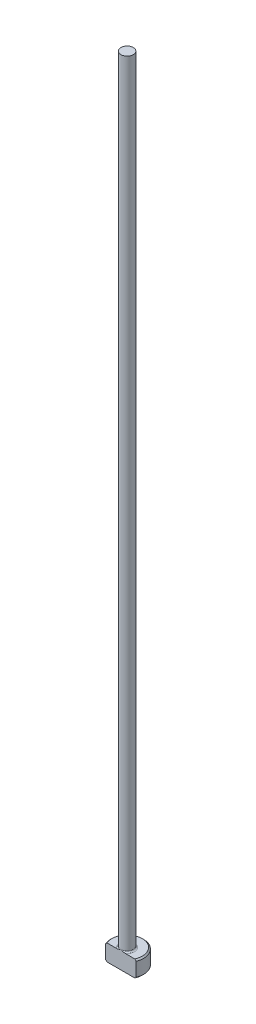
ISO-10303-21;
HEADER;
FILE_DESCRIPTION(('STEP AP214'),'2;1');
FILE_NAME('part.step','',(''),(''),'','','');
FILE_SCHEMA(('AUTOMOTIVE_DESIGN { 1 0 10303 214 1 1 1 1 }'));
ENDSEC;
DATA;
#1=APPLICATION_CONTEXT('core data for automotive mechanical design processes');
#2=APPLICATION_PROTOCOL_DEFINITION('international standard','automotive_design',2000,#1);
#3=PRODUCT_CONTEXT('',#1,'mechanical');
#4=PRODUCT('Part','Part','',(#3));
#5=PRODUCT_RELATED_PRODUCT_CATEGORY('part','',(#4));
#6=PRODUCT_DEFINITION_FORMATION('','',#4);
#7=PRODUCT_DEFINITION_CONTEXT('part definition',#1,'design');
#8=PRODUCT_DEFINITION('design','',#6,#7);
#9=PRODUCT_DEFINITION_SHAPE('','',#8);
#10=(LENGTH_UNIT() NAMED_UNIT(*) SI_UNIT(.MILLI.,.METRE.));
#11=(NAMED_UNIT(*) PLANE_ANGLE_UNIT() SI_UNIT($,.RADIAN.));
#12=(NAMED_UNIT(*) SI_UNIT($,.STERADIAN.) SOLID_ANGLE_UNIT());
#13=UNCERTAINTY_MEASURE_WITH_UNIT(LENGTH_MEASURE(1.E-05),#10,'distance_accuracy_value','');
#14=(GEOMETRIC_REPRESENTATION_CONTEXT(3) GLOBAL_UNCERTAINTY_ASSIGNED_CONTEXT((#13)) GLOBAL_UNIT_ASSIGNED_CONTEXT((#10,
#11,#12)) REPRESENTATION_CONTEXT('',''));
#15=CARTESIAN_POINT('',(0.,0.,0.));
#16=DIRECTION('',(0.,0.,1.));
#17=DIRECTION('',(1.,0.,0.));
#18=AXIS2_PLACEMENT_3D('',#15,#16,#17);
#19=CARTESIAN_POINT('',(0.,0.,0.));
#20=DIRECTION('',(0.,-1.,0.));
#21=DIRECTION('',(0.,0.,-1.));
#22=AXIS2_PLACEMENT_3D('',#19,#20,#21);
#23=PLANE('',#22);
#24=CARTESIAN_POINT('',(0.,0.,0.));
#25=DIRECTION('',(0.,-1.,0.));
#26=DIRECTION('',(0.,0.,-1.));
#27=AXIS2_PLACEMENT_3D('',#24,#25,#26);
#28=CIRCLE('',#27,2.92099999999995);
#29=CARTESIAN_POINT('',(-2.66761406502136,0.,1.18998999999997));
#30=VERTEX_POINT('',#29);
#31=CARTESIAN_POINT('',(2.66761406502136,0.,1.18998999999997));
#32=VERTEX_POINT('',#31);
#33=EDGE_CURVE('E98',#30,#32,#28,.T.);
#34=ORIENTED_EDGE('',*,*,#33,.T.);
#35=DIRECTION('',(-1.,0.,0.));
#36=VECTOR('',#35,1.);
#37=CARTESIAN_POINT('',(-2.94356056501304,0.,1.18998999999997));
#38=LINE('',#37,#36);
#39=EDGE_CURVE('E83',#32,#30,#38,.T.);
#40=ORIENTED_EDGE('',*,*,#39,.T.);
#41=EDGE_LOOP('',(#34,#40));
#42=FACE_BOUND('',#41,.T.);
#43=ADVANCED_FACE('F32',(#42),#23,.T.);
#44=CARTESIAN_POINT('',(0.,259.958771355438,0.));
#45=DIRECTION('',(0.,1.,0.));
#46=DIRECTION('',(0.,0.,1.));
#47=AXIS2_PLACEMENT_3D('',#44,#45,#46);
#48=CYLINDRICAL_SURFACE('',#47,3.17499999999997);
#49=CARTESIAN_POINT('',(0.,2.92099999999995,0.));
#50=DIRECTION('',(0.,1.,0.));
#51=DIRECTION('',(0.,0.,1.));
#52=AXIS2_PLACEMENT_3D('',#49,#50,#51);
#53=CIRCLE('',#52,3.17499999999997);
#54=CARTESIAN_POINT('',(-2.94356056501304,2.92099999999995,1.18998999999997));
#55=VERTEX_POINT('',#54);
#56=CARTESIAN_POINT('',(2.94356056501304,2.92099999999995,1.18998999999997));
#57=VERTEX_POINT('',#56);
#58=EDGE_CURVE('E104',#55,#57,#53,.F.);
#59=ORIENTED_EDGE('',*,*,#58,.T.);
#60=DIRECTION('',(0.,-1.,0.));
#61=VECTOR('',#60,1.);
#62=CARTESIAN_POINT('',(2.94356056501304,152.4,1.18998999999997));
#63=LINE('',#62,#61);
#64=CARTESIAN_POINT('',(2.94356056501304,0.254000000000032,1.18998999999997));
#65=VERTEX_POINT('',#64);
#66=EDGE_CURVE('E183',#57,#65,#63,.T.);
#67=ORIENTED_EDGE('',*,*,#66,.T.);
#68=CARTESIAN_POINT('',(0.,0.254000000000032,0.));
#69=DIRECTION('',(0.,-1.,0.));
#70=DIRECTION('',(0.,0.,-1.));
#71=AXIS2_PLACEMENT_3D('',#68,#69,#70);
#72=CIRCLE('',#71,3.17499999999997);
#73=CARTESIAN_POINT('',(-2.94356056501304,0.254000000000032,1.18998999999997));
#74=VERTEX_POINT('',#73);
#75=EDGE_CURVE('E100',#65,#74,#72,.F.);
#76=ORIENTED_EDGE('',*,*,#75,.T.);
#77=DIRECTION('',(0.,-1.,0.));
#78=VECTOR('',#77,1.);
#79=CARTESIAN_POINT('',(-2.94356056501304,152.4,1.18998999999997));
#80=LINE('',#79,#78);
#81=EDGE_CURVE('E93',#55,#74,#80,.T.);
#82=ORIENTED_EDGE('',*,*,#81,.F.);
#83=EDGE_LOOP('',(#59,#67,#76,#82));
#84=FACE_BOUND('',#83,.T.);
#85=ADVANCED_FACE('F158',(#84),#48,.T.);
#86=CARTESIAN_POINT('',(-3.17499999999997,3.175,0.));
#87=DIRECTION('',(0.,1.,0.));
#88=DIRECTION('',(0.,0.,1.));
#89=AXIS2_PLACEMENT_3D('',#86,#87,#88);
#90=PLANE('',#89);
#91=CARTESIAN_POINT('',(0.,3.175,0.));
#92=DIRECTION('',(0.,1.,0.));
#93=DIRECTION('',(0.,0.,1.));
#94=AXIS2_PLACEMENT_3D('',#91,#92,#93);
#95=CIRCLE('',#94,2.92099999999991);
#96=CARTESIAN_POINT('',(2.66761406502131,3.175,1.18998999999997));
#97=VERTEX_POINT('',#96);
#98=CARTESIAN_POINT('',(-2.66761406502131,3.175,1.18998999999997));
#99=VERTEX_POINT('',#98);
#100=EDGE_CURVE('E178',#97,#99,#95,.T.);
#101=ORIENTED_EDGE('',*,*,#100,.T.);
#102=DIRECTION('',(1.,0.,0.));
#103=VECTOR('',#102,1.);
#104=CARTESIAN_POINT('',(-3.17499999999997,3.175,1.18998999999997));
#105=LINE('',#104,#103);
#106=CARTESIAN_POINT('',(-0.817943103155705,3.17500000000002,1.18998999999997));
#107=VERTEX_POINT('',#106);
#108=EDGE_CURVE('E57',#99,#107,#105,.T.);
#109=ORIENTED_EDGE('',*,*,#108,.T.);
#110=CARTESIAN_POINT('',(0.,3.175,0.));
#111=DIRECTION('',(0.,1.,0.));
#112=DIRECTION('',(0.,0.,1.));
#113=AXIS2_PLACEMENT_3D('',#110,#111,#112);
#114=CIRCLE('',#113,1.44398999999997);
#115=CARTESIAN_POINT('',(0.817943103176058,3.17500000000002,1.18998999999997));
#116=VERTEX_POINT('',#115);
#117=EDGE_CURVE('E107',#107,#116,#114,.F.);
#118=ORIENTED_EDGE('',*,*,#117,.T.);
#119=EDGE_CURVE('E136',#116,#97,#105,.T.);
#120=ORIENTED_EDGE('',*,*,#119,.T.);
#121=EDGE_LOOP('',(#101,#109,#118,#120));
#122=FACE_BOUND('',#121,.T.);
#123=ADVANCED_FACE('F147',(#122),#90,.T.);
#124=CARTESIAN_POINT('',(0.,3.17499999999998,0.));
#125=DIRECTION('',(0.,-1.,0.));
#126=DIRECTION('',(0.,0.,-1.));
#127=AXIS2_PLACEMENT_3D('',#124,#125,#126);
#128=CONICAL_SURFACE('',#127,2.92099999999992,0.785398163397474);
#129=ORIENTED_EDGE('',*,*,#58,.F.);
#130=CARTESIAN_POINT('',(-6.47931936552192,-0.491689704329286,1.18998999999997));
#131=CARTESIAN_POINT('',(-6.3057518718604,-0.320986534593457,1.18998999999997));
#132=CARTESIAN_POINT('',(-6.13208094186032,-0.150388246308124,1.18998999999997));
#133=CARTESIAN_POINT('',(-5.78425276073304,0.190708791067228,1.18998999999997));
#134=CARTESIAN_POINT('',(-5.610095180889,0.361207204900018,1.18998999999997));
#135=CARTESIAN_POINT('',(-5.25789988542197,0.705253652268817,1.18998999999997));
#136=CARTESIAN_POINT('',(-5.07985463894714,0.878793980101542,1.18998999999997));
#137=CARTESIAN_POINT('',(-4.72344726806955,1.22514212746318,1.18998999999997));
#138=CARTESIAN_POINT('',(-4.54508573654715,1.39795055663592,1.18998999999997));
#139=CARTESIAN_POINT('',(-4.22178053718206,1.70987820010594,1.18998999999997));
#140=CARTESIAN_POINT('',(-4.07696186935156,1.84912689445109,1.18998999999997));
#141=CARTESIAN_POINT('',(-3.78666752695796,2.1269755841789,1.18998999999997));
#142=CARTESIAN_POINT('',(-3.64119177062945,2.26557549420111,1.18998999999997));
#143=CARTESIAN_POINT('',(-3.34872942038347,2.54243487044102,1.18998999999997));
#144=CARTESIAN_POINT('',(-3.20173902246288,2.68069032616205,1.18998999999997));
#145=CARTESIAN_POINT('',(-2.90653907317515,2.95574973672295,1.18998999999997));
#146=CARTESIAN_POINT('',(-2.75833015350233,3.09255436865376,1.18998999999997));
#147=CARTESIAN_POINT('',(-2.46256150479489,3.36167470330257,1.18998999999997));
#148=CARTESIAN_POINT('',(-2.31503539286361,3.49402709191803,1.18998999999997));
#149=CARTESIAN_POINT('',(-2.09131974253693,3.69008529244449,1.18998999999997));
#150=CARTESIAN_POINT('',(-2.01626900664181,3.75508852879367,1.18998999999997));
#151=CARTESIAN_POINT('',(-1.86516644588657,3.88390741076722,1.18998999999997));
#152=CARTESIAN_POINT('',(-1.78911473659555,3.94772319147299,1.18998999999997));
#153=CARTESIAN_POINT('',(-1.63628476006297,4.07322581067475,1.18998999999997));
#154=CARTESIAN_POINT('',(-1.55951715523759,4.13492558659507,1.18998999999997));
#155=CARTESIAN_POINT('',(-1.40419805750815,4.25603341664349,1.18998999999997));
#156=CARTESIAN_POINT('',(-1.32564684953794,4.31544183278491,1.18998999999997));
#157=CARTESIAN_POINT('',(-1.16630337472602,4.43067355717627,1.18998999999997));
#158=CARTESIAN_POINT('',(-1.0855185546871,4.48650710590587,1.18998999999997));
#159=CARTESIAN_POINT('',(-0.920537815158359,4.59284659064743,1.18998999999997));
#160=CARTESIAN_POINT('',(-0.836346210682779,4.64335899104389,1.18998999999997));
#161=CARTESIAN_POINT('',(-0.730888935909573,4.69956746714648,1.18998999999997));
#162=CARTESIAN_POINT('',(-0.71184810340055,4.70944634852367,1.18998999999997));
#163=CARTESIAN_POINT('',(-0.67352119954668,4.72872851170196,1.18998999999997));
#164=CARTESIAN_POINT('',(-0.654235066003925,4.73813166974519,1.18998999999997));
#165=CARTESIAN_POINT('',(-0.59599952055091,4.76554209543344,1.18998999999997));
#166=CARTESIAN_POINT('',(-0.556668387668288,4.7827527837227,1.18998999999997));
#167=CARTESIAN_POINT('',(-0.477355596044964,4.81434640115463,1.18998999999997));
#168=CARTESIAN_POINT('',(-0.437385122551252,4.82875715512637,1.18998999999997));
#169=CARTESIAN_POINT('',(-0.356410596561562,4.85437528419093,1.18998999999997));
#170=CARTESIAN_POINT('',(-0.31540652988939,4.86558261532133,1.18998999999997));
#171=CARTESIAN_POINT('',(-0.239749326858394,4.88255703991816,1.18998999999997));
#172=CARTESIAN_POINT('',(-0.205233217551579,4.88893154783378,1.18998999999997));
#173=CARTESIAN_POINT('',(-0.135794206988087,4.89877967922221,1.18998999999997));
#174=CARTESIAN_POINT('',(-0.100871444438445,4.90225426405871,1.18998999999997));
#175=CARTESIAN_POINT('',(-0.0309424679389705,4.90611831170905,1.18998999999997));
#176=CARTESIAN_POINT('',(0.00406330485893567,4.90651563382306,1.18998999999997));
#177=CARTESIAN_POINT('',(0.0739860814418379,4.90422492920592,1.18998999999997));
#178=CARTESIAN_POINT('',(0.108903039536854,4.90153554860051,1.18998999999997));
#179=CARTESIAN_POINT('',(0.185811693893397,4.89231772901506,1.18998999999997));
#180=CARTESIAN_POINT('',(0.227719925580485,4.88509144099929,1.18998999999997));
#181=CARTESIAN_POINT('',(0.310690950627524,4.86678744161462,1.18998999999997));
#182=CARTESIAN_POINT('',(0.351753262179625,4.85570759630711,1.18998999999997));
#183=CARTESIAN_POINT('',(0.433130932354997,4.83023017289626,1.18998999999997));
#184=CARTESIAN_POINT('',(0.473439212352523,4.8158103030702,1.18998999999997));
#185=CARTESIAN_POINT('',(0.552977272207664,4.78431092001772,1.18998999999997));
#186=CARTESIAN_POINT('',(0.592207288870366,4.76723199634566,1.18998999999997));
#187=CARTESIAN_POINT('',(0.705140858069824,4.7143405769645,1.18998999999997));
#188=CARTESIAN_POINT('',(0.777512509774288,4.67569611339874,1.18998999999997));
#189=CARTESIAN_POINT('',(0.919347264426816,4.59335368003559,1.18998999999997));
#190=CARTESIAN_POINT('',(0.988806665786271,4.54964952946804,1.18998999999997));
#191=CARTESIAN_POINT('',(1.12574256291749,4.45870111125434,1.18998999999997));
#192=CARTESIAN_POINT('',(1.19321018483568,4.41144359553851,1.18998999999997));
#193=CARTESIAN_POINT('',(1.32639871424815,4.31461731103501,1.18998999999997));
#194=CARTESIAN_POINT('',(1.39212046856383,4.26504969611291,1.18998999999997));
#195=CARTESIAN_POINT('',(1.52321682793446,4.163508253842,1.18998999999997));
#196=CARTESIAN_POINT('',(1.58857229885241,4.11150983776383,1.18998999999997));
#197=CARTESIAN_POINT('',(1.71826265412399,4.00624640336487,1.18998999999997));
#198=CARTESIAN_POINT('',(1.78259742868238,3.95298125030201,1.18998999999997));
#199=CARTESIAN_POINT('',(1.9103046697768,3.84563387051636,1.18998999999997));
#200=CARTESIAN_POINT('',(1.97367914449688,3.79155402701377,1.18998999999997));
#201=CARTESIAN_POINT('',(2.09979151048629,3.68266386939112,1.18998999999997));
#202=CARTESIAN_POINT('',(2.1625294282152,3.62785358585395,1.18998999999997));
#203=CARTESIAN_POINT('',(2.32034022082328,3.48869772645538,1.18998999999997));
#204=CARTESIAN_POINT('',(2.41507621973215,3.40397040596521,1.18998999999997));
#205=CARTESIAN_POINT('',(2.60367921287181,3.23355294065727,1.18998999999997));
#206=CARTESIAN_POINT('',(2.69754618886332,3.14786277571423,1.18998999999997));
#207=CARTESIAN_POINT('',(2.97818594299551,2.88972120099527,1.18998999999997));
#208=CARTESIAN_POINT('',(3.1639838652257,2.71621092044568,1.18998999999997));
#209=CARTESIAN_POINT('',(3.53424564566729,2.36730235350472,1.18998999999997));
#210=CARTESIAN_POINT('',(3.71870746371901,2.19190191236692,1.18998999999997));
#211=CARTESIAN_POINT('',(4.08658256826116,1.84002104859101,1.18998999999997));
#212=CARTESIAN_POINT('',(4.26999589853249,1.66354067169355,1.18998999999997));
#213=CARTESIAN_POINT('',(4.62290911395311,1.3225888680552,1.18998999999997));
#214=CARTESIAN_POINT('',(4.79245879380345,1.1581689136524,1.18998999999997));
#215=CARTESIAN_POINT('',(5.13110594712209,0.828859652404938,1.18998999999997));
#216=CARTESIAN_POINT('',(5.30020341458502,0.663970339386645,1.18998999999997));
#217=CARTESIAN_POINT('',(5.63778854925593,0.334103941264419,1.18998999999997));
#218=CARTESIAN_POINT('',(5.80627675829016,0.169127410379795,1.18998999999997));
#219=CARTESIAN_POINT('',(6.14298232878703,-0.161096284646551,1.18998999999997));
#220=CARTESIAN_POINT('',(6.31119969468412,-0.326343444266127,1.18998999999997));
#221=CARTESIAN_POINT('',(6.47931936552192,-0.491689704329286,1.18998999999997));
#222=B_SPLINE_CURVE_WITH_KNOTS('',3,(#130,#131,#132,#133,#134,#135,#136,#137,#138,#139,#140,
#141,#142,#143,#144,#145,#146,#147,#148,#149,#150,#151,#152,#153,#154,#155,#156,#157,#158,#159,
#160,#161,#162,#163,#164,#165,#166,#167,#168,#169,#170,#171,#172,#173,#174,#175,#176,#177,#178,
#179,#180,#181,#182,#183,#184,#185,#186,#187,#188,#189,#190,#191,#192,#193,#194,#195,#196,#197,
#198,#199,#200,#201,#202,#203,#204,#205,#206,#207,#208,#209,#210,#211,#212,#213,#214,#215,#216,
#217,#218,#219,#220,#221),.UNSPECIFIED.,.F.,.F.,(4,2,2,2,2,2,2,2,2,2,2,2,2,2,2,2,2,2,2,2,2,2,2,
2,2,2,2,2,2,2,2,2,2,2,2,2,2,2,2,2,2,2,2,2,2,4),(0.,0.730333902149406,1.46150049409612,
2.20738656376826,2.95242206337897,3.55513421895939,4.15792356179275,4.76329855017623,
5.3683773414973,5.96292222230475,6.26077664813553,6.55859698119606,6.85403741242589,
7.14943097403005,7.44393654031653,7.7380800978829,7.80242723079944,7.866791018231,
7.99550301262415,8.12286192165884,8.25022257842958,8.35541203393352,8.46056660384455,
8.56545252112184,8.67038446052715,8.79775050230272,8.92518718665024,9.05350023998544,
9.18178488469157,9.4275558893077,9.67363035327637,9.92067269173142,10.1675929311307,
10.4181243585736,10.6686825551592,10.9186125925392,11.1685321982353,11.5498128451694,
11.9311014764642,12.6937337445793,13.4573540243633,14.2209421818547,14.9294812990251,
15.638029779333,16.3454542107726,17.0528669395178),.UNSPECIFIED.);
#223=EDGE_CURVE('E135',#55,#99,#222,.T.);
#224=ORIENTED_EDGE('',*,*,#223,.T.);
#225=ORIENTED_EDGE('',*,*,#100,.F.);
#226=EDGE_CURVE('E127',#97,#57,#222,.T.);
#227=ORIENTED_EDGE('',*,*,#226,.T.);
#228=EDGE_LOOP('',(#129,#224,#225,#227));
#229=FACE_BOUND('',#228,.T.);
#230=ADVANCED_FACE('F143',(#229),#128,.T.);
#231=CARTESIAN_POINT('',(0.,0.254000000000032,0.));
#232=DIRECTION('',(0.,1.,0.));
#233=DIRECTION('',(0.,0.,1.));
#234=AXIS2_PLACEMENT_3D('',#231,#232,#233);
#235=CONICAL_SURFACE('',#234,3.17499999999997,0.785398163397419);
#236=ORIENTED_EDGE('',*,*,#75,.F.);
#237=CARTESIAN_POINT('',(6.47931936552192,3.66668970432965,1.18998999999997));
#238=CARTESIAN_POINT('',(6.30575187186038,3.49598653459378,1.18998999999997));
#239=CARTESIAN_POINT('',(6.13208094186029,3.32538824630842,1.18998999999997));
#240=CARTESIAN_POINT('',(5.78425276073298,2.98429120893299,1.18998999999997));
#241=CARTESIAN_POINT('',(5.61009518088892,2.81379279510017,1.18998999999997));
#242=CARTESIAN_POINT('',(5.25789988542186,2.4697463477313,1.18998999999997));
#243=CARTESIAN_POINT('',(5.07985463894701,2.29620601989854,1.18998999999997));
#244=CARTESIAN_POINT('',(4.72344726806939,1.94985787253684,1.18998999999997));
#245=CARTESIAN_POINT('',(4.54508573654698,1.77704944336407,1.18998999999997));
#246=CARTESIAN_POINT('',(4.22178053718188,1.46512179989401,1.18998999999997));
#247=CARTESIAN_POINT('',(4.0769618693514,1.32587310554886,1.18998999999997));
#248=CARTESIAN_POINT('',(3.78666752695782,1.04802441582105,1.18998999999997));
#249=CARTESIAN_POINT('',(3.64119177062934,0.909424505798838,1.18998999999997));
#250=CARTESIAN_POINT('',(3.34872942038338,0.632565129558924,1.18998999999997));
#251=CARTESIAN_POINT('',(3.20173902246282,0.494309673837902,1.18998999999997));
#252=CARTESIAN_POINT('',(2.90653907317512,0.219250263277,1.18998999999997));
#253=CARTESIAN_POINT('',(2.75833015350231,0.0824456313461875,1.18998999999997));
#254=CARTESIAN_POINT('',(2.4625615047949,-0.186674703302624,1.18998999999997));
#255=CARTESIAN_POINT('',(2.31503539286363,-0.319027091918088,1.18998999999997));
#256=CARTESIAN_POINT('',(2.09131974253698,-0.515085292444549,1.18998999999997));
#257=CARTESIAN_POINT('',(2.01626900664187,-0.58008852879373,1.18998999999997));
#258=CARTESIAN_POINT('',(1.86516644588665,-0.708907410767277,1.18998999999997));
#259=CARTESIAN_POINT('',(1.78911473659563,-0.772723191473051,1.18998999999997));
#260=CARTESIAN_POINT('',(1.63628476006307,-0.898225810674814,1.18998999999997));
#261=CARTESIAN_POINT('',(1.5595171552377,-0.959925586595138,1.18998999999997));
#262=CARTESIAN_POINT('',(1.40419805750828,-1.08103341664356,1.18998999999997));
#263=CARTESIAN_POINT('',(1.32564684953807,-1.14044183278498,1.18998999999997));
#264=CARTESIAN_POINT('',(1.16630337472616,-1.25567355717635,1.18998999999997));
#265=CARTESIAN_POINT('',(1.08551855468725,-1.31150710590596,1.18998999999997));
#266=CARTESIAN_POINT('',(0.920537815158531,-1.41784659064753,1.18998999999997));
#267=CARTESIAN_POINT('',(0.83634621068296,-1.46835899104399,1.18998999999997));
#268=CARTESIAN_POINT('',(0.730888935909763,-1.5245674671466,1.18998999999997));
#269=CARTESIAN_POINT('',(0.71184810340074,-1.53444634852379,1.18998999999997));
#270=CARTESIAN_POINT('',(0.673521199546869,-1.55372851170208,1.18998999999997));
#271=CARTESIAN_POINT('',(0.654235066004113,-1.56313166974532,1.18998999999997));
#272=CARTESIAN_POINT('',(0.595999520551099,-1.59054209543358,1.18998999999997));
#273=CARTESIAN_POINT('',(0.556668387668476,-1.60775278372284,1.18998999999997));
#274=CARTESIAN_POINT('',(0.47735559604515,-1.63934640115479,1.18998999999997));
#275=CARTESIAN_POINT('',(0.437385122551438,-1.65375715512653,1.18998999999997));
#276=CARTESIAN_POINT('',(0.356410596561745,-1.67937528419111,1.18998999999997));
#277=CARTESIAN_POINT('',(0.31540652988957,-1.69058261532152,1.18998999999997));
#278=CARTESIAN_POINT('',(0.239749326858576,-1.70755703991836,1.18998999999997));
#279=CARTESIAN_POINT('',(0.205233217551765,-1.71393154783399,1.18998999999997));
#280=CARTESIAN_POINT('',(0.135794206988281,-1.72377967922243,1.18998999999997));
#281=CARTESIAN_POINT('',(0.100871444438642,-1.72725426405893,1.18998999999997));
#282=CARTESIAN_POINT('',(0.030942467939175,-1.73111831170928,1.18998999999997));
#283=CARTESIAN_POINT('',(-0.00406330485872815,-1.73151563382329,1.18998999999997));
#284=CARTESIAN_POINT('',(-0.0739860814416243,-1.72922492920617,1.18998999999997));
#285=CARTESIAN_POINT('',(-0.108903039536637,-1.72653554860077,1.18998999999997));
#286=CARTESIAN_POINT('',(-0.185811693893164,-1.71731772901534,1.18998999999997));
#287=CARTESIAN_POINT('',(-0.227719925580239,-1.71009144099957,1.18998999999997));
#288=CARTESIAN_POINT('',(-0.310690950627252,-1.69178744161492,1.18998999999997));
#289=CARTESIAN_POINT('',(-0.351753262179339,-1.68070759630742,1.18998999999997));
#290=CARTESIAN_POINT('',(-0.433130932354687,-1.6552301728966,1.18998999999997));
#291=CARTESIAN_POINT('',(-0.4734392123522,-1.64081030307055,1.18998999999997));
#292=CARTESIAN_POINT('',(-0.552977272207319,-1.60931092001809,1.18998999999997));
#293=CARTESIAN_POINT('',(-0.592207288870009,-1.59223199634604,1.18998999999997));
#294=CARTESIAN_POINT('',(-0.705140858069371,-1.53934057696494,1.18998999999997));
#295=CARTESIAN_POINT('',(-0.777512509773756,-1.50069611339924,1.18998999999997));
#296=CARTESIAN_POINT('',(-0.919347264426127,-1.41835368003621,1.18998999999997));
#297=CARTESIAN_POINT('',(-0.988806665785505,-1.37464952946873,1.18998999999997));
#298=CARTESIAN_POINT('',(-1.12574256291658,-1.28370111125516,1.18998999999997));
#299=CARTESIAN_POINT('',(-1.19321018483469,-1.2364435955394,1.18998999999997));
#300=CARTESIAN_POINT('',(-1.32639871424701,-1.13961731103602,1.18998999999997));
#301=CARTESIAN_POINT('',(-1.39212046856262,-1.09004969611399,1.18998999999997));
#302=CARTESIAN_POINT('',(-1.52321682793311,-0.988508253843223,1.18998999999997));
#303=CARTESIAN_POINT('',(-1.58857229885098,-0.93650983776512,1.18998999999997));
#304=CARTESIAN_POINT('',(-1.71826265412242,-0.831246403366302,1.18998999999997));
#305=CARTESIAN_POINT('',(-1.78259742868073,-0.777981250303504,1.18998999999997));
#306=CARTESIAN_POINT('',(-1.91030466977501,-0.67063387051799,1.18998999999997));
#307=CARTESIAN_POINT('',(-1.97367914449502,-0.61655402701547,1.18998999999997));
#308=CARTESIAN_POINT('',(-2.09979151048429,-0.507663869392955,1.18998999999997));
#309=CARTESIAN_POINT('',(-2.16252942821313,-0.45285358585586,1.18998999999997));
#310=CARTESIAN_POINT('',(-2.32034022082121,-0.313697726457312,1.18998999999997));
#311=CARTESIAN_POINT('',(-2.41507621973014,-0.228970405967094,1.18998999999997));
#312=CARTESIAN_POINT('',(-2.60367921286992,-0.0585529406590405,1.18998999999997));
#313=CARTESIAN_POINT('',(-2.69754618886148,0.0271372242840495,1.18998999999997));
#314=CARTESIAN_POINT('',(-2.97818594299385,0.285278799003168,1.18998999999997));
#315=CARTESIAN_POINT('',(-3.16398386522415,0.458789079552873,1.18998999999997));
#316=CARTESIAN_POINT('',(-3.53424564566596,0.807697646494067,1.18998999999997));
#317=CARTESIAN_POINT('',(-3.71870746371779,0.983098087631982,1.18998999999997));
#318=CARTESIAN_POINT('',(-4.08658256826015,1.33497895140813,1.18998999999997));
#319=CARTESIAN_POINT('',(-4.26999589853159,1.51145932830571,1.18998999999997));
#320=CARTESIAN_POINT('',(-4.62290911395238,1.85241113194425,1.18998999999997));
#321=CARTESIAN_POINT('',(-4.79245879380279,2.01683108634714,1.18998999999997));
#322=CARTESIAN_POINT('',(-5.13110594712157,2.34614034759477,1.18998999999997));
#323=CARTESIAN_POINT('',(-5.30020341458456,2.51102966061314,1.18998999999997));
#324=CARTESIAN_POINT('',(-5.63778854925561,2.84089605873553,1.18998999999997));
#325=CARTESIAN_POINT('',(-5.8062767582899,3.00587258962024,1.18998999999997));
#326=CARTESIAN_POINT('',(-6.1429823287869,3.33609628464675,1.18998999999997));
#327=CARTESIAN_POINT('',(-6.31119969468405,3.50134344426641,1.18998999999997));
#328=CARTESIAN_POINT('',(-6.47931936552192,3.66668970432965,1.18998999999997));
#329=B_SPLINE_CURVE_WITH_KNOTS('',3,(#237,#238,#239,#240,#241,#242,#243,#244,#245,#246,#247,
#248,#249,#250,#251,#252,#253,#254,#255,#256,#257,#258,#259,#260,#261,#262,#263,#264,#265,#266,
#267,#268,#269,#270,#271,#272,#273,#274,#275,#276,#277,#278,#279,#280,#281,#282,#283,#284,#285,
#286,#287,#288,#289,#290,#291,#292,#293,#294,#295,#296,#297,#298,#299,#300,#301,#302,#303,#304,
#305,#306,#307,#308,#309,#310,#311,#312,#313,#314,#315,#316,#317,#318,#319,#320,#321,#322,#323,
#324,#325,#326,#327,#328),.UNSPECIFIED.,.F.,.F.,(4,2,2,2,2,2,2,2,2,2,2,2,2,2,2,2,2,2,2,2,2,2,2,
2,2,2,2,2,2,2,2,2,2,2,2,2,2,2,2,2,2,2,2,2,2,4),(0.,0.730333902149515,1.46150049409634,
2.20738656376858,2.95242206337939,3.55513421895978,4.15792356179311,4.76329855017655,
5.36837734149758,5.962922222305,6.26077664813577,6.55859698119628,6.8540374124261,
7.14943097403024,7.44393654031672,7.73808009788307,7.80242723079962,7.86679101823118,
7.99550301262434,8.12286192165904,8.25022257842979,8.35541203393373,8.46056660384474,
8.56545252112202,8.67038446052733,8.79775050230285,8.92518718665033,9.05350023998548,
9.18178488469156,9.4275558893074,9.67363035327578,9.92067269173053,10.1675929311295,
10.4181243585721,10.6686825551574,10.9186125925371,11.1685321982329,11.5498128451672,
11.9311014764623,12.6937337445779,13.4573540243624,14.2209421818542,14.929481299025,
15.6380297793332,16.3454542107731,17.0528669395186),.UNSPECIFIED.);
#330=EDGE_CURVE('E86',#65,#32,#329,.T.);
#331=ORIENTED_EDGE('',*,*,#330,.T.);
#332=ORIENTED_EDGE('',*,*,#33,.F.);
#333=EDGE_CURVE('E89',#30,#74,#329,.T.);
#334=ORIENTED_EDGE('',*,*,#333,.T.);
#335=EDGE_LOOP('',(#236,#331,#332,#334));
#336=FACE_BOUND('',#335,.T.);
#337=ADVANCED_FACE('F97',(#336),#235,.T.);
#338=CARTESIAN_POINT('',(0.,3.42900000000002,0.));
#339=DIRECTION('',(0.,1.,0.));
#340=DIRECTION('',(0.,0.,1.));
#341=AXIS2_PLACEMENT_3D('',#338,#339,#340);
#342=TOROIDAL_SURFACE('',#341,1.44398999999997,0.254);
#343=CARTESIAN_POINT('',(0.,3.42900000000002,1.18998999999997));
#344=CARTESIAN_POINT('',(1.26787740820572E-12,3.42900058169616,1.18998999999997));
#345=CARTESIAN_POINT('',(1.02037080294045E-07,3.42900116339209,1.18998999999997));
#346=CARTESIAN_POINT('',(4.36423737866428E-07,3.42900229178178,1.18998999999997));
#347=CARTESIAN_POINT('',(6.71040769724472E-07,3.42900283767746,1.18998999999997));
#348=CARTESIAN_POINT('',(1.23856841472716E-06,3.42900392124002,1.18998999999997));
#349=CARTESIAN_POINT('',(1.57695860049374E-06,3.42900445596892,1.18998999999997));
#350=CARTESIAN_POINT('',(2.31458772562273E-06,3.42900547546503,1.18998999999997));
#351=CARTESIAN_POINT('',(2.71349856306E-06,3.42900596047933,1.18998999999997));
#352=CARTESIAN_POINT('',(4.11884078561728E-06,3.42900754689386,1.18998999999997));
#353=CARTESIAN_POINT('',(5.20568846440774E-06,3.42900857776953,1.18998999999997));
#354=CARTESIAN_POINT('',(7.47790847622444E-06,3.42901044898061,1.18998999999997));
#355=CARTESIAN_POINT('',(8.65996322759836E-06,3.42901129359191,1.18998999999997));
#356=CARTESIAN_POINT('',(1.31663854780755E-05,3.42901436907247,1.18998999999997));
#357=CARTESIAN_POINT('',(1.6609768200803E-05,3.42901643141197,1.18998999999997));
#358=CARTESIAN_POINT('',(2.34843039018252E-05,3.42901989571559,1.18998999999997));
#359=CARTESIAN_POINT('',(2.68971573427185E-05,3.42902133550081,1.18998999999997));
#360=CARTESIAN_POINT('',(4.11260389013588E-05,3.42902727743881,1.18998999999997));
#361=CARTESIAN_POINT('',(5.19833878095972E-05,3.42903166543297,1.18998999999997));
#362=CARTESIAN_POINT('',(7.24910575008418E-05,3.42903888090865,1.18998999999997));
#363=CARTESIAN_POINT('',(8.20928106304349E-05,3.42904184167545,1.18998999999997));
#364=CARTESIAN_POINT('',(0.000150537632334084,3.42906480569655,1.18998999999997));
#365=CARTESIAN_POINT('',(0.000206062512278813,3.42909344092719,1.18998999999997));
#366=CARTESIAN_POINT('',(0.000420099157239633,3.42919967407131,1.18998999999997));
#367=CARTESIAN_POINT('',(0.000580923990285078,3.42927086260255,1.18998999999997));
#368=CARTESIAN_POINT('',(0.00119866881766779,3.42954850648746,1.18998999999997));
#369=CARTESIAN_POINT('',(0.00165320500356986,3.42976167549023,1.18998999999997));
#370=CARTESIAN_POINT('',(0.00349115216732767,3.43061934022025,1.18998999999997));
#371=CARTESIAN_POINT('',(0.00487719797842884,3.43125630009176,1.18998999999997));
#372=CARTESIAN_POINT('',(0.027245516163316,3.44154091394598,1.18998999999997));
#373=CARTESIAN_POINT('',(0.0482060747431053,3.45125229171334,1.18998999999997));
#374=CARTESIAN_POINT('',(0.0894544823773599,3.47019581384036,1.18998999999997));
#375=CARTESIAN_POINT('',(0.109740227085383,3.47943284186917,1.18998999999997));
#376=CARTESIAN_POINT('',(0.152645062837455,3.49874471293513,1.18998999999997));
#377=CARTESIAN_POINT('',(0.175273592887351,3.50879895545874,1.18998999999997));
#378=CARTESIAN_POINT('',(0.220904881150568,3.52864652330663,1.18998999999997));
#379=CARTESIAN_POINT('',(0.243909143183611,3.53843639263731,1.18998999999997));
#380=CARTESIAN_POINT('',(0.301812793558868,3.56234769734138,1.18998999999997));
#381=CARTESIAN_POINT('',(0.336843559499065,3.5761555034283,1.18998999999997));
#382=CARTESIAN_POINT('',(0.406753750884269,3.60184766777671,1.18998999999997));
#383=CARTESIAN_POINT('',(0.441620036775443,3.61376719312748,1.18998999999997));
#384=CARTESIAN_POINT('',(0.50021476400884,3.63181866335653,1.18998999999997));
#385=CARTESIAN_POINT('',(0.523756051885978,3.63855079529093,1.18998999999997));
#386=CARTESIAN_POINT('',(0.571256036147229,3.65089320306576,1.18998999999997));
#387=CARTESIAN_POINT('',(0.595216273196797,3.65649741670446,1.18998999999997));
#388=CARTESIAN_POINT('',(0.669974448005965,3.6717221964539,1.18998999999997));
#389=CARTESIAN_POINT('',(0.721326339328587,3.67898748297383,1.18998999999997));
#390=CARTESIAN_POINT('',(0.80486783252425,3.68348474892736,1.18998999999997));
#391=CARTESIAN_POINT('',(0.836903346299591,3.6834849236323,1.18998999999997));
#392=CARTESIAN_POINT('',(0.900349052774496,3.67912359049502,1.18998999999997));
#393=CARTESIAN_POINT('',(0.931762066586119,3.67481634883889,1.18998999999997));
#394=CARTESIAN_POINT('',(0.98360843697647,3.66299454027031,1.18998999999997));
#395=CARTESIAN_POINT('',(1.00436819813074,3.65692785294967,1.18998999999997));
#396=CARTESIAN_POINT('',(1.04483432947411,3.64179163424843,1.18998999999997));
#397=CARTESIAN_POINT('',(1.06453980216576,3.63271959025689,1.18998999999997));
#398=CARTESIAN_POINT('',(1.09672199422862,3.61416783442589,1.18998999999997));
#399=CARTESIAN_POINT('',(1.10967469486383,3.60551806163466,1.18998999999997));
#400=CARTESIAN_POINT('',(1.13407930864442,3.58631142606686,1.18998999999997));
#401=CARTESIAN_POINT('',(1.1455339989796,3.57575818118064,1.18998999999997));
#402=CARTESIAN_POINT('',(1.16408929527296,3.555205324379,1.18998999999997));
#403=CARTESIAN_POINT('',(1.17159652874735,3.54557455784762,1.18998999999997));
#404=CARTESIAN_POINT('',(1.18494613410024,3.52520962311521,1.18998999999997));
#405=CARTESIAN_POINT('',(1.19078913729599,3.51447587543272,1.18998999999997));
#406=CARTESIAN_POINT('',(1.20047872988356,3.4920216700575,1.18998999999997));
#407=CARTESIAN_POINT('',(1.20430808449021,3.48029366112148,1.18998999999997));
#408=CARTESIAN_POINT('',(1.20958011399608,3.45631266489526,1.18998999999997));
#409=CARTESIAN_POINT('',(1.2110249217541,3.44406015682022,1.18998999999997));
#410=CARTESIAN_POINT('',(1.21137893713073,3.42120864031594,1.18998999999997));
#411=CARTESIAN_POINT('',(1.21060887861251,3.41061344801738,1.18998999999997));
#412=CARTESIAN_POINT('',(1.20725809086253,3.3897162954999,1.18998999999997));
#413=CARTESIAN_POINT('',(1.20467751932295,3.37941430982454,1.18998999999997));
#414=CARTESIAN_POINT('',(1.19793821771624,3.35957884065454,1.18998999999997));
#415=CARTESIAN_POINT('',(1.19381228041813,3.35003406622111,1.18998999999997));
#416=CARTESIAN_POINT('',(1.18419596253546,3.33166440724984,1.18998999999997));
#417=CARTESIAN_POINT('',(1.17870510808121,3.32283977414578,1.18998999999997));
#418=CARTESIAN_POINT('',(1.16411880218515,3.30258488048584,1.18998999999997));
#419=CARTESIAN_POINT('',(1.15446574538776,3.29155545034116,1.18998999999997));
#420=CARTESIAN_POINT('',(1.13349747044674,3.27120205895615,1.18998999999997));
#421=CARTESIAN_POINT('',(1.12217832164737,3.26188225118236,1.18998999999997));
#422=CARTESIAN_POINT('',(1.09350772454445,3.24144295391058,1.18998999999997));
#423=CARTESIAN_POINT('',(1.07557783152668,3.23113789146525,1.18998999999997));
#424=CARTESIAN_POINT('',(1.03838039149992,3.21349111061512,1.18998999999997));
#425=CARTESIAN_POINT('',(1.01911345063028,3.20614805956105,1.18998999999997));
#426=CARTESIAN_POINT('',(0.968966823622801,3.19064433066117,1.18998999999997));
#427=CARTESIAN_POINT('',(0.937540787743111,3.1842646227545,1.18998999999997));
#428=CARTESIAN_POINT('',(0.873763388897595,3.17625798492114,1.18998999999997));
#429=CARTESIAN_POINT('',(0.841405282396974,3.17469515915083,1.18998999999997));
#430=CARTESIAN_POINT('',(0.750100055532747,3.17569533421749,1.18998999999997));
#431=CARTESIAN_POINT('',(0.691210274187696,3.18271821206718,1.18998999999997));
#432=CARTESIAN_POINT('',(0.605738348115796,3.19911877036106,1.18998999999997));
#433=CARTESIAN_POINT('',(0.578411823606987,3.2053292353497,1.18998999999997));
#434=CARTESIAN_POINT('',(0.524295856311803,3.21923824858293,1.18998999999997));
#435=CARTESIAN_POINT('',(0.497504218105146,3.22692795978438,1.18998999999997));
#436=CARTESIAN_POINT('',(0.436219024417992,3.24603766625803,1.18998999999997));
#437=CARTESIAN_POINT('',(0.401860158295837,3.25788100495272,1.18998999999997));
#438=CARTESIAN_POINT('',(0.332941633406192,3.28335943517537,1.18998999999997));
#439=CARTESIAN_POINT('',(0.298394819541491,3.29702881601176,1.18998999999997));
#440=CARTESIAN_POINT('',(0.241232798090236,3.3206946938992,1.18998999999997));
#441=CARTESIAN_POINT('',(0.218491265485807,3.33039062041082,1.18998999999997));
#442=CARTESIAN_POINT('',(0.17337776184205,3.35003926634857,1.18998999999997));
#443=CARTESIAN_POINT('',(0.151004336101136,3.35998864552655,1.18998999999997));
#444=CARTESIAN_POINT('',(0.108581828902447,3.3790939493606,1.18998999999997));
#445=CARTESIAN_POINT('',(0.0885236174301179,3.38822996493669,1.18998999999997));
#446=CARTESIAN_POINT('',(0.0477371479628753,3.40696407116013,1.18998999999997));
#447=CARTESIAN_POINT('',(0.0270109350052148,3.41656691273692,1.18998999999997));
#448=CARTESIAN_POINT('',(0.00487721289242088,3.42674369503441,1.18998999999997));
#449=CARTESIAN_POINT('',(0.00349118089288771,3.42738064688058,1.18998999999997));
#450=CARTESIAN_POINT('',(0.00165323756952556,3.42823830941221,1.18998999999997));
#451=CARTESIAN_POINT('',(0.00119869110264,3.42845148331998,1.18998999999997));
#452=CARTESIAN_POINT('',(0.000580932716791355,3.42872913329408,1.18998999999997));
#453=CARTESIAN_POINT('',(0.000420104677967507,3.42880032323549,1.18998999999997));
#454=CARTESIAN_POINT('',(0.000206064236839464,3.4289065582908,1.18998999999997));
#455=CARTESIAN_POINT('',(0.000150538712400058,3.42893519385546,1.18998999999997));
#456=CARTESIAN_POINT('',(8.20931379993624E-05,3.42895815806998,1.18998999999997));
#457=CARTESIAN_POINT('',(7.24913302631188E-05,3.42896111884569,1.18998999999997));
#458=CARTESIAN_POINT('',(5.19835428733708E-05,3.42896833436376,1.18998999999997));
#459=CARTESIAN_POINT('',(4.11261323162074E-05,3.42897272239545,1.18998999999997));
#460=CARTESIAN_POINT('',(2.68971812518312E-05,3.42897866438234,1.18998999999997));
#461=CARTESIAN_POINT('',(2.34843186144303E-05,3.42898010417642,1.18998999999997));
#462=CARTESIAN_POINT('',(1.66097659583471E-05,3.42898356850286,1.18998999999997));
#463=CARTESIAN_POINT('',(1.31663757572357E-05,3.42898563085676,1.18998999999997));
#464=CARTESIAN_POINT('',(8.65994662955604E-06,3.42898870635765,1.18998999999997));
#465=CARTESIAN_POINT('',(7.47789109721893E-06,3.42898955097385,1.18998999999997));
#466=CARTESIAN_POINT('',(5.20567052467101E-06,3.42899142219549,1.18998999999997));
#467=CARTESIAN_POINT('',(4.11882310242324E-06,3.42899245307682,1.18998999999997));
#468=CARTESIAN_POINT('',(2.71348243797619E-06,3.42899403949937,1.18998999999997));
#469=CARTESIAN_POINT('',(2.31457228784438E-06,3.42899452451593,1.18998999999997));
#470=CARTESIAN_POINT('',(1.57694493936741E-06,3.42899554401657,1.18998999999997));
#471=CARTESIAN_POINT('',(1.23855584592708E-06,3.42899607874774,1.18998999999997));
#472=CARTESIAN_POINT('',(6.71030864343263E-07,3.4289971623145,1.18998999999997));
#473=CARTESIAN_POINT('',(4.36415361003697E-07,3.42899770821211,1.18998999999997));
#474=CARTESIAN_POINT('',(1.02032397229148E-07,3.42899883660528,1.18998999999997));
#475=CARTESIAN_POINT('',(-1.26787982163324E-12,3.42899941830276,1.18998999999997));
#476=CARTESIAN_POINT('',(0.,3.42900000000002,1.18998999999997));
#477=B_SPLINE_CURVE_WITH_KNOTS('',3,(#343,#344,#345,#346,#347,#348,#349,#350,#351,#352,#353,
#354,#355,#356,#357,#358,#359,#360,#361,#362,#363,#364,#365,#366,#367,#368,#369,#370,#371,#372,
#373,#374,#375,#376,#377,#378,#379,#380,#381,#382,#383,#384,#385,#386,#387,#388,#389,#390,#391,
#392,#393,#394,#395,#396,#397,#398,#399,#400,#401,#402,#403,#404,#405,#406,#407,#408,#409,#410,
#411,#412,#413,#414,#415,#416,#417,#418,#419,#420,#421,#422,#423,#424,#425,#426,#427,#428,#429,
#430,#431,#432,#433,#434,#435,#436,#437,#438,#439,#440,#441,#442,#443,#444,#445,#446,#447,#448,
#449,#450,#451,#452,#453,#454,#455,#456,#457,#458,#459,#460,#461,#462,#463,#464,#465,#466,#467,
#468,#469,#470,#471,#472,#473,#474,#475,#476),.UNSPECIFIED.,.T.,.F.,(4,2,2,2,2,2,2,2,2,2,2,2,2,
2,2,2,2,2,2,2,2,2,2,2,2,2,2,2,2,2,2,2,2,2,2,2,2,2,2,2,2,2,2,2,2,2,2,2,2,2,2,2,2,2,2,2,2,2,2,2,2,
2,2,2,2,2,4),(0.,1.74334279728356E-06,3.51742687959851E-06,5.40897466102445E-06,
7.2906118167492E-06,1.1762316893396E-05,1.61171458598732E-05,2.81146681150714E-05,
3.92160061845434E-05,7.43362867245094E-05,0.00010445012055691,0.000291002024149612,
0.000819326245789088,0.0023245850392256,0.00690166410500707,0.0761955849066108,
0.143066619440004,0.21734866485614,0.292347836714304,0.405281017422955,0.515769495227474,
0.589195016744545,0.663005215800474,0.817937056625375,0.913834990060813,1.00853980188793,
1.07324987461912,1.13801418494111,1.18459093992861,1.23108008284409,1.26757344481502,
1.30405294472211,1.3408397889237,1.37759371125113,1.40930419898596,1.44101192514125,
1.47208177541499,1.50316242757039,1.54688970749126,1.59072185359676,1.6524169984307,
1.71408435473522,1.80974843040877,1.90668024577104,2.08347049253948,2.1675319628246,
2.2511060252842,2.36008753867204,2.47151858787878,2.54568247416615,2.61913749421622,
2.68526172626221,2.7537809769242,2.75835800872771,2.75986330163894,2.7603916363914,
2.76057819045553,2.76060830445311,2.76064342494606,2.76065452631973,2.76066652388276,
2.76067087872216,2.7606753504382,2.76067723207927,2.76067912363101,2.76068089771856,
2.76068264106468),.UNSPECIFIED.);
#478=CARTESIAN_POINT('',(0.,3.42900000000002,1.18998999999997));
#479=VERTEX_POINT('',#478);
#480=EDGE_CURVE('E11',#116,#479,#477,.T.);
#481=ORIENTED_EDGE('',*,*,#480,.F.);
#482=ORIENTED_EDGE('',*,*,#117,.F.);
#483=CARTESIAN_POINT('',(0.,3.42900000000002,1.18998999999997));
#484=CARTESIAN_POINT('',(-1.26785873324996E-12,3.42899941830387,1.18998999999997));
#485=CARTESIAN_POINT('',(-1.02037080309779E-07,3.42899883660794,1.18998999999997));
#486=CARTESIAN_POINT('',(-4.36423737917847E-07,3.42899770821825,1.18998999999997));
#487=CARTESIAN_POINT('',(-6.7104076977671E-07,3.42899716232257,1.18998999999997));
#488=CARTESIAN_POINT('',(-1.2385684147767E-06,3.42899607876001,1.18998999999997));
#489=CARTESIAN_POINT('',(-1.57695860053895E-06,3.42899554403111,1.18998999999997));
#490=CARTESIAN_POINT('',(-2.31458772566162E-06,3.428994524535,1.18998999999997));
#491=CARTESIAN_POINT('',(-2.71349856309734E-06,3.4289940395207,1.18998999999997));
#492=CARTESIAN_POINT('',(-4.11884078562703E-06,3.42899245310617,1.18998999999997));
#493=CARTESIAN_POINT('',(-5.20568846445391E-06,3.4289914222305,1.18998999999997));
#494=CARTESIAN_POINT('',(-7.47790847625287E-06,3.42898955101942,1.18998999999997));
#495=CARTESIAN_POINT('',(-8.65996322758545E-06,3.42898870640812,1.18998999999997));
#496=CARTESIAN_POINT('',(-1.3166385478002E-05,3.42898563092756,1.18998999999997));
#497=CARTESIAN_POINT('',(-1.66097682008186E-05,3.42898356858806,1.18998999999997));
#498=CARTESIAN_POINT('',(-2.34843039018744E-05,3.42898010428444,1.18998999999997));
#499=CARTESIAN_POINT('',(-2.68971573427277E-05,3.42897866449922,1.18998999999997));
#500=CARTESIAN_POINT('',(-4.11260389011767E-05,3.42897272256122,1.18998999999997));
#501=CARTESIAN_POINT('',(-5.1983387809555E-05,3.42896833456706,1.18998999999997));
#502=CARTESIAN_POINT('',(-7.24910575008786E-05,3.42896111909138,1.18998999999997));
#503=CARTESIAN_POINT('',(-8.20928106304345E-05,3.42895815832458,1.18998999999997));
#504=CARTESIAN_POINT('',(-0.000150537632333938,3.42893519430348,1.18998999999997));
#505=CARTESIAN_POINT('',(-0.000206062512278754,3.42890655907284,1.18998999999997));
#506=CARTESIAN_POINT('',(-0.000420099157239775,3.42880032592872,1.18998999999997));
#507=CARTESIAN_POINT('',(-0.000580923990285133,3.42872913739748,1.18998999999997));
#508=CARTESIAN_POINT('',(-0.00119866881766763,3.42845149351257,1.18998999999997));
#509=CARTESIAN_POINT('',(-0.00165320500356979,3.4282383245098,1.18998999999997));
#510=CARTESIAN_POINT('',(-0.00349115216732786,3.42738065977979,1.18998999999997));
#511=CARTESIAN_POINT('',(-0.00487719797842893,3.42674369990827,1.18998999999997));
#512=CARTESIAN_POINT('',(-0.0272455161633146,3.41645908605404,1.18998999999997));
#513=CARTESIAN_POINT('',(-0.0482060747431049,3.40674770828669,1.18998999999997));
#514=CARTESIAN_POINT('',(-0.0894544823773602,3.38780418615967,1.18998999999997));
#515=CARTESIAN_POINT('',(-0.109740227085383,3.37856715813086,1.18998999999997));
#516=CARTESIAN_POINT('',(-0.152645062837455,3.3592552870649,1.18998999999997));
#517=CARTESIAN_POINT('',(-0.175273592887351,3.34920104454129,1.18998999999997));
#518=CARTESIAN_POINT('',(-0.220904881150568,3.3293534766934,1.18998999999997));
#519=CARTESIAN_POINT('',(-0.243909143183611,3.31956360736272,1.18998999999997));
#520=CARTESIAN_POINT('',(-0.301812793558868,3.29565230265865,1.18998999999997));
#521=CARTESIAN_POINT('',(-0.336843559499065,3.28184449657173,1.18998999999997));
#522=CARTESIAN_POINT('',(-0.406753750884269,3.25615233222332,1.18998999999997));
#523=CARTESIAN_POINT('',(-0.441620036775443,3.24423280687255,1.18998999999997));
#524=CARTESIAN_POINT('',(-0.50021476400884,3.2261813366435,1.18998999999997));
#525=CARTESIAN_POINT('',(-0.523756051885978,3.2194492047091,1.18998999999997));
#526=CARTESIAN_POINT('',(-0.571256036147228,3.20710679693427,1.18998999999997));
#527=CARTESIAN_POINT('',(-0.595216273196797,3.20150258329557,1.18998999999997));
#528=CARTESIAN_POINT('',(-0.669974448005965,3.18627780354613,1.18998999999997));
#529=CARTESIAN_POINT('',(-0.721326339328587,3.1790125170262,1.18998999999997));
#530=CARTESIAN_POINT('',(-0.80486783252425,3.17451525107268,1.18998999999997));
#531=CARTESIAN_POINT('',(-0.836903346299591,3.17451507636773,1.18998999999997));
#532=CARTESIAN_POINT('',(-0.900349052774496,3.17887640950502,1.18998999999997));
#533=CARTESIAN_POINT('',(-0.931762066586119,3.18318365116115,1.18998999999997));
#534=CARTESIAN_POINT('',(-0.98360843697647,3.19500545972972,1.18998999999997));
#535=CARTESIAN_POINT('',(-1.00436819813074,3.20107214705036,1.18998999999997));
#536=CARTESIAN_POINT('',(-1.04483432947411,3.2162083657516,1.18998999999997));
#537=CARTESIAN_POINT('',(-1.06453980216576,3.22528040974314,1.18998999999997));
#538=CARTESIAN_POINT('',(-1.09672199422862,3.24383216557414,1.18998999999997));
#539=CARTESIAN_POINT('',(-1.10967469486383,3.25248193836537,1.18998999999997));
#540=CARTESIAN_POINT('',(-1.13407930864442,3.27168857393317,1.18998999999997));
#541=CARTESIAN_POINT('',(-1.1455339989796,3.28224181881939,1.18998999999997));
#542=CARTESIAN_POINT('',(-1.16408929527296,3.30279467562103,1.18998999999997));
#543=CARTESIAN_POINT('',(-1.17159652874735,3.31242544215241,1.18998999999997));
#544=CARTESIAN_POINT('',(-1.18494613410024,3.33279037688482,1.18998999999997));
#545=CARTESIAN_POINT('',(-1.19078913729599,3.34352412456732,1.18998999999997));
#546=CARTESIAN_POINT('',(-1.20047872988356,3.36597832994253,1.18998999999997));
#547=CARTESIAN_POINT('',(-1.20430808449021,3.37770633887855,1.18998999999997));
#548=CARTESIAN_POINT('',(-1.20958011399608,3.40168733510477,1.18998999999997));
#549=CARTESIAN_POINT('',(-1.2110249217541,3.41393984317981,1.18998999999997));
#550=CARTESIAN_POINT('',(-1.21137893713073,3.43679135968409,1.18998999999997));
#551=CARTESIAN_POINT('',(-1.21060887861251,3.44738655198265,1.18998999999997));
#552=CARTESIAN_POINT('',(-1.20725809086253,3.46828370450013,1.18998999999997));
#553=CARTESIAN_POINT('',(-1.20467751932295,3.47858569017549,1.18998999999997));
#554=CARTESIAN_POINT('',(-1.19793821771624,3.49842115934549,1.18998999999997));
#555=CARTESIAN_POINT('',(-1.19381228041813,3.50796593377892,1.18998999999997));
#556=CARTESIAN_POINT('',(-1.18419596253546,3.5263355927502,1.18998999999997));
#557=CARTESIAN_POINT('',(-1.17870510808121,3.53516022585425,1.18998999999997));
#558=CARTESIAN_POINT('',(-1.16411880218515,3.55541511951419,1.18998999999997));
#559=CARTESIAN_POINT('',(-1.15446574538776,3.56644454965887,1.18998999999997));
#560=CARTESIAN_POINT('',(-1.13349747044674,3.58679794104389,1.18998999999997));
#561=CARTESIAN_POINT('',(-1.12217832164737,3.59611774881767,1.18998999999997));
#562=CARTESIAN_POINT('',(-1.09350772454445,3.61655704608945,1.18998999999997));
#563=CARTESIAN_POINT('',(-1.07557783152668,3.62686210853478,1.18998999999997));
#564=CARTESIAN_POINT('',(-1.03838039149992,3.64450888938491,1.18998999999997));
#565=CARTESIAN_POINT('',(-1.01911345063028,3.65185194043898,1.18998999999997));
#566=CARTESIAN_POINT('',(-0.968966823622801,3.66735566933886,1.18998999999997));
#567=CARTESIAN_POINT('',(-0.937540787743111,3.67373537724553,1.18998999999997));
#568=CARTESIAN_POINT('',(-0.873763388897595,3.68174201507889,1.18998999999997));
#569=CARTESIAN_POINT('',(-0.841405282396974,3.6833048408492,1.18998999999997));
#570=CARTESIAN_POINT('',(-0.750100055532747,3.68230466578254,1.18998999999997));
#571=CARTESIAN_POINT('',(-0.691210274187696,3.67528178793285,1.18998999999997));
#572=CARTESIAN_POINT('',(-0.605738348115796,3.65888122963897,1.18998999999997));
#573=CARTESIAN_POINT('',(-0.578411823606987,3.65267076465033,1.18998999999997));
#574=CARTESIAN_POINT('',(-0.524295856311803,3.6387617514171,1.18998999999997));
#575=CARTESIAN_POINT('',(-0.497504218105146,3.63107204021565,1.18998999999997));
#576=CARTESIAN_POINT('',(-0.436219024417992,3.611962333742,1.18998999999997));
#577=CARTESIAN_POINT('',(-0.401860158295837,3.60011899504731,1.18998999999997));
#578=CARTESIAN_POINT('',(-0.332941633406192,3.57464056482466,1.18998999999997));
#579=CARTESIAN_POINT('',(-0.298394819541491,3.56097118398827,1.18998999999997));
#580=CARTESIAN_POINT('',(-0.241232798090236,3.53730530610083,1.18998999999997));
#581=CARTESIAN_POINT('',(-0.218491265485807,3.52760937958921,1.18998999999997));
#582=CARTESIAN_POINT('',(-0.17337776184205,3.50796073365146,1.18998999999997));
#583=CARTESIAN_POINT('',(-0.151004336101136,3.49801135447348,1.18998999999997));
#584=CARTESIAN_POINT('',(-0.108581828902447,3.47890605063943,1.18998999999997));
#585=CARTESIAN_POINT('',(-0.0885236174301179,3.46977003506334,1.18998999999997));
#586=CARTESIAN_POINT('',(-0.0477371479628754,3.4510359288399,1.18998999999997));
#587=CARTESIAN_POINT('',(-0.0270109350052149,3.44143308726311,1.18998999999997));
#588=CARTESIAN_POINT('',(-0.00487721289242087,3.43125630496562,1.18998999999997));
#589=CARTESIAN_POINT('',(-0.00349118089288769,3.43061935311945,1.18998999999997));
#590=CARTESIAN_POINT('',(-0.00165323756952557,3.42976169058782,1.18998999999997));
#591=CARTESIAN_POINT('',(-0.00119869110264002,3.42954851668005,1.18998999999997));
#592=CARTESIAN_POINT('',(-0.000580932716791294,3.42927086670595,1.18998999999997));
#593=CARTESIAN_POINT('',(-0.000420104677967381,3.42919967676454,1.18998999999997));
#594=CARTESIAN_POINT('',(-0.000206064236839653,3.42909344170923,1.18998999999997));
#595=CARTESIAN_POINT('',(-0.000150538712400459,3.42906480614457,1.18998999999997));
#596=CARTESIAN_POINT('',(-8.20931379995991E-05,3.42904184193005,1.18998999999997));
#597=CARTESIAN_POINT('',(-7.24913302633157E-05,3.42903888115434,1.18998999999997));
#598=CARTESIAN_POINT('',(-5.19835428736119E-05,3.42903166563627,1.18998999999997));
#599=CARTESIAN_POINT('',(-4.11261323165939E-05,3.42902727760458,1.18998999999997));
#600=CARTESIAN_POINT('',(-2.6897181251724E-05,3.42902133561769,1.18998999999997));
#601=CARTESIAN_POINT('',(-2.34843186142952E-05,3.42901989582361,1.18998999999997));
#602=CARTESIAN_POINT('',(-1.66097659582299E-05,3.42901643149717,1.18998999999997));
#603=CARTESIAN_POINT('',(-1.3166375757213E-05,3.42901436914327,1.18998999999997));
#604=CARTESIAN_POINT('',(-8.6599466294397E-06,3.42901129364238,1.18998999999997));
#605=CARTESIAN_POINT('',(-7.47789109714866E-06,3.42901044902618,1.18998999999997));
#606=CARTESIAN_POINT('',(-5.20567052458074E-06,3.42900857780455,1.18998999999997));
#607=CARTESIAN_POINT('',(-4.11882310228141E-06,3.42900754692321,1.18998999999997));
#608=CARTESIAN_POINT('',(-2.71348243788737E-06,3.42900596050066,1.18998999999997));
#609=CARTESIAN_POINT('',(-2.31457228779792E-06,3.4290054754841,1.18998999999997));
#610=CARTESIAN_POINT('',(-1.57694493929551E-06,3.42900445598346,1.18998999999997));
#611=CARTESIAN_POINT('',(-1.23855584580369E-06,3.42900392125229,1.18998999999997));
#612=CARTESIAN_POINT('',(-6.71030864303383E-07,3.42900283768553,1.18998999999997));
#613=CARTESIAN_POINT('',(-4.36415361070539E-07,3.42900229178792,1.18998999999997));
#614=CARTESIAN_POINT('',(-1.02032397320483E-07,3.42900116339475,1.18998999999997));
#615=CARTESIAN_POINT('',(1.26786114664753E-12,3.42900058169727,1.18998999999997));
#616=CARTESIAN_POINT('',(0.,3.42900000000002,1.18998999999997));
#617=B_SPLINE_CURVE_WITH_KNOTS('',3,(#483,#484,#485,#486,#487,#488,#489,#490,#491,#492,#493,
#494,#495,#496,#497,#498,#499,#500,#501,#502,#503,#504,#505,#506,#507,#508,#509,#510,#511,#512,
#513,#514,#515,#516,#517,#518,#519,#520,#521,#522,#523,#524,#525,#526,#527,#528,#529,#530,#531,
#532,#533,#534,#535,#536,#537,#538,#539,#540,#541,#542,#543,#544,#545,#546,#547,#548,#549,#550,
#551,#552,#553,#554,#555,#556,#557,#558,#559,#560,#561,#562,#563,#564,#565,#566,#567,#568,#569,
#570,#571,#572,#573,#574,#575,#576,#577,#578,#579,#580,#581,#582,#583,#584,#585,#586,#587,#588,
#589,#590,#591,#592,#593,#594,#595,#596,#597,#598,#599,#600,#601,#602,#603,#604,#605,#606,#607,
#608,#609,#610,#611,#612,#613,#614,#615,#616),.UNSPECIFIED.,.T.,.F.,(4,2,2,2,2,2,2,2,2,2,2,2,2,
2,2,2,2,2,2,2,2,2,2,2,2,2,2,2,2,2,2,2,2,2,2,2,2,2,2,2,2,2,2,2,2,2,2,2,2,2,2,2,2,2,2,2,2,2,2,2,2,
2,2,2,2,2,4),(0.,1.74334279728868E-06,3.51742687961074E-06,5.40897466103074E-06,
7.29061181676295E-06,1.176231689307E-05,1.61171458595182E-05,2.81146681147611E-05,
3.92160061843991E-05,7.43362867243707E-05,0.000104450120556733,0.000291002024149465,
0.000819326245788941,0.00232458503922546,0.00690166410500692,0.0761955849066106,
0.143066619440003,0.217348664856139,0.292347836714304,0.405281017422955,0.515769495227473,
0.589195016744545,0.663005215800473,0.817937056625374,0.913834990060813,1.00853980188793,
1.07324987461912,1.13801418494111,1.18459093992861,1.23108008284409,1.26757344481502,
1.30405294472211,1.34083978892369,1.37759371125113,1.40930419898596,1.44101192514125,
1.47208177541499,1.50316242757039,1.54688970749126,1.59072185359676,1.6524169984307,
1.71408435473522,1.80974843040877,1.90668024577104,2.08347049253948,2.1675319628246,
2.2511060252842,2.36008753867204,2.47151858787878,2.54568247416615,2.61913749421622,
2.68526172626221,2.7537809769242,2.75835800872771,2.75986330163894,2.7603916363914,
2.76057819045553,2.76060830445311,2.76064342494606,2.76065452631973,2.76066652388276,
2.76067087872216,2.7606753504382,2.76067723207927,2.76067912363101,2.76068089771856,
2.76068264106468),.UNSPECIFIED.);
#618=EDGE_CURVE('E46',#479,#107,#617,.T.);
#619=ORIENTED_EDGE('',*,*,#618,.F.);
#620=CARTESIAN_POINT('',(0.,3.42900000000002,0.));
#621=DIRECTION('',(0.,1.,0.));
#622=DIRECTION('',(0.,0.,1.));
#623=AXIS2_PLACEMENT_3D('',#620,#621,#622);
#624=CIRCLE('',#623,1.18998999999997);
#625=EDGE_CURVE('E103',#479,#479,#624,.T.);
#626=ORIENTED_EDGE('',*,*,#625,.F.);
#627=EDGE_LOOP('',(#481,#482,#619,#626));
#628=FACE_BOUND('',#627,.T.);
#629=ADVANCED_FACE('F34',(#628),#342,.F.);
#630=CARTESIAN_POINT('',(0.,259.958771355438,0.));
#631=DIRECTION('',(0.,1.,0.));
#632=DIRECTION('',(0.,0.,1.));
#633=AXIS2_PLACEMENT_3D('',#630,#631,#632);
#634=CYLINDRICAL_SURFACE('',#633,1.18998999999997);
#635=ORIENTED_EDGE('',*,*,#625,.T.);
#636=EDGE_LOOP('',(#635));
#637=FACE_BOUND('',#636,.T.);
#638=CARTESIAN_POINT('',(0.,152.4,0.));
#639=DIRECTION('',(0.,1.,0.));
#640=DIRECTION('',(0.,0.,1.));
#641=AXIS2_PLACEMENT_3D('',#638,#639,#640);
#642=CIRCLE('',#641,1.18998999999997);
#643=CARTESIAN_POINT('',(0.,152.4,1.18998999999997));
#644=VERTEX_POINT('',#643);
#645=EDGE_CURVE('E101',#644,#644,#642,.T.);
#646=ORIENTED_EDGE('',*,*,#645,.F.);
#647=EDGE_LOOP('',(#646));
#648=FACE_BOUND('',#647,.T.);
#649=ADVANCED_FACE('F155',(#637,#648),#634,.T.);
#650=CARTESIAN_POINT('',(-1.18998999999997,152.4,0.));
#651=DIRECTION('',(0.,1.,0.));
#652=DIRECTION('',(0.,0.,1.));
#653=AXIS2_PLACEMENT_3D('',#650,#651,#652);
#654=PLANE('',#653);
#655=ORIENTED_EDGE('',*,*,#645,.T.);
#656=EDGE_LOOP('',(#655));
#657=FACE_BOUND('',#656,.T.);
#658=ADVANCED_FACE('F121',(#657),#654,.T.);
#659=CARTESIAN_POINT('',(-2.94356056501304,152.4,1.18998999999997));
#660=DIRECTION('',(0.,0.,1.));
#661=DIRECTION('',(1.,0.,0.));
#662=AXIS2_PLACEMENT_3D('',#659,#660,#661);
#663=PLANE('',#662);
#664=ORIENTED_EDGE('',*,*,#66,.F.);
#665=ORIENTED_EDGE('',*,*,#226,.F.);
#666=ORIENTED_EDGE('',*,*,#119,.F.);
#667=ORIENTED_EDGE('',*,*,#480,.T.);
#668=ORIENTED_EDGE('',*,*,#618,.T.);
#669=ORIENTED_EDGE('',*,*,#108,.F.);
#670=ORIENTED_EDGE('',*,*,#223,.F.);
#671=ORIENTED_EDGE('',*,*,#81,.T.);
#672=ORIENTED_EDGE('',*,*,#333,.F.);
#673=ORIENTED_EDGE('',*,*,#39,.F.);
#674=ORIENTED_EDGE('',*,*,#330,.F.);
#675=EDGE_LOOP('',(#664,#665,#666,#667,#668,#669,#670,#671,#672,#673,#674));
#676=FACE_BOUND('',#675,.T.);
#677=ADVANCED_FACE('F85',(#676),#663,.T.);
#678=CLOSED_SHELL('',(#43,#85,#123,#230,#337,#629,#649,#658,#677));
#679=MANIFOLD_SOLID_BREP('B2',#678);
#680=ADVANCED_BREP_SHAPE_REPRESENTATION('',(#18,#679),#14);
#681=SHAPE_DEFINITION_REPRESENTATION(#9,#680);
ENDSEC;
END-ISO-10303-21;
